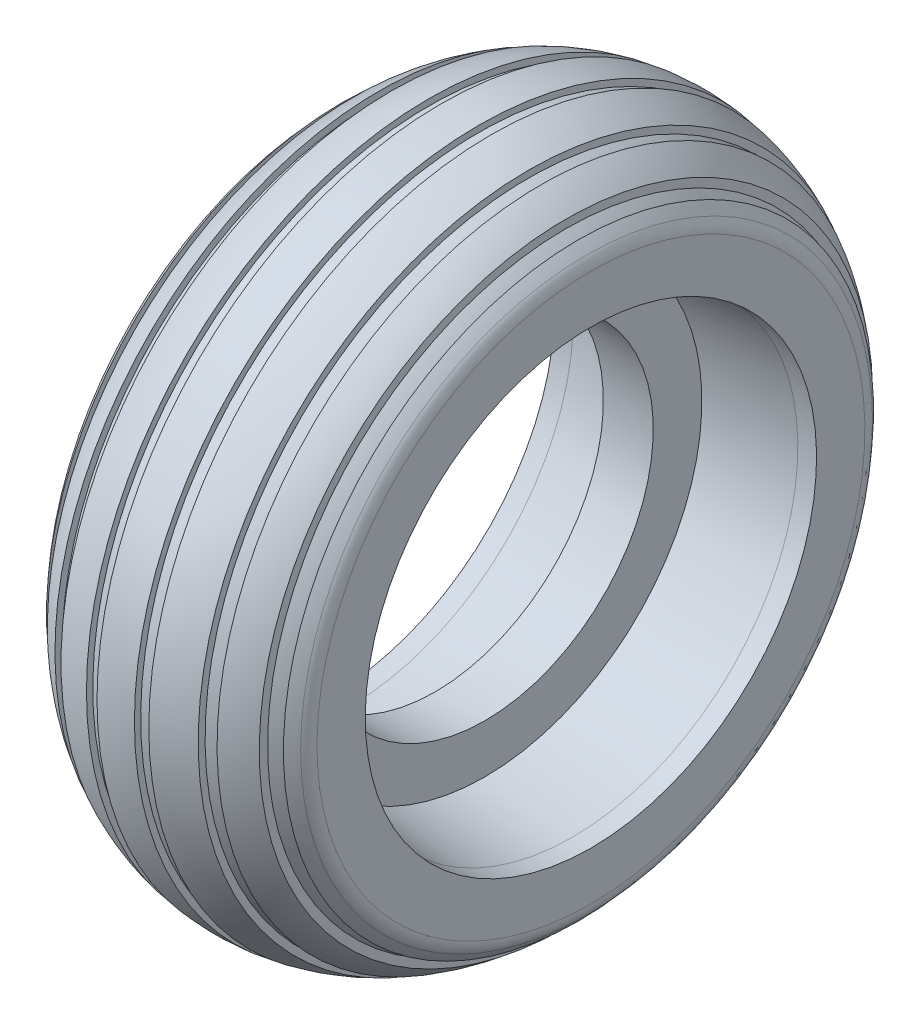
from build123d import *


with BuildPart() as part:
    # Esquisse1 → R_volution2 (revolve)
    with BuildSketch(Plane.XY, mode=Mode.PRIVATE) as r_volution2_sk:
        with BuildLine():
            Line((-10.5, 18.1), (-10.5, 21.976504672))
            ThreePointArc((-10.5, 21.976504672), (-10.410784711, 22.486099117), (-10.153751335, 22.935075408))
            ThreePointArc((-10.153751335, 22.935075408), (-9.833651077, 23.306120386), (-9.5, 23.665029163))
            Line((-9.5, 23.665029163), (-9.5, 22.929010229))
            ThreePointArc((-9.5, 22.929010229), (-9.014084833, 23.446702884), (-8.5, 23.936433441))
            Line((-8.5, 23.936433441), (-8.5, 24.599305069))
            ThreePointArc((-8.5, 24.599305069), (-7.532111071, 25.340287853), (-6.5, 25.988833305))
            Line((-6.5, 25.988833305), (-6.5, 25.410703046))
            ThreePointArc((-6.5, 25.410703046), (-6.005997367, 25.690214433), (-5.5, 25.947375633))
            Line((-5.5, 25.947375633), (-5.5, 26.499679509))
            ThreePointArc((-5.5, 26.499679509), (-4.028782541, 27.07020773), (-2.5, 27.461113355))
            Line((-2.5, 27.461113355), (-2.5, 26.951525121))
            ThreePointArc((-2.5, 26.951525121), (-2.001591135, 27.041289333), (-1.5, 27.111112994))
            Line((-1.5, 27.111112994), (-1.5, 27.614502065))
            ThreePointArc((-1.5, 27.614502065), (0, 27.7), (1.5, 27.614502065))
            Line((1.5, 27.614502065), (1.5, 27.111112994))
            ThreePointArc((1.5, 27.111112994), (2.001591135, 27.041289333), (2.5, 26.951525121))
            Line((2.5, 26.951525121), (2.5, 27.461113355))
            ThreePointArc((2.5, 27.461113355), (4.028782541, 27.07020773), (5.5, 26.499679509))
            Line((5.5, 26.499679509), (5.5, 25.947375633))
            ThreePointArc((5.5, 25.947375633), (6.005997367, 25.690214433), (6.5, 25.410703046))
            Line((6.5, 25.410703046), (6.5, 25.988833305))
            ThreePointArc((6.5, 25.988833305), (7.532111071, 25.340287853), (8.5, 24.599305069))
            Line((8.5, 24.599305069), (8.5, 23.936433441))
            ThreePointArc((8.5, 23.936433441), (9.014084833, 23.446702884), (9.5, 22.929010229))
            Line((9.5, 22.929010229), (9.5, 23.665029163))
            ThreePointArc((9.5, 23.665029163), (9.833651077, 23.306120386), (10.153751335, 22.935075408))
            ThreePointArc((10.153751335, 22.935075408), (10.410784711, 22.486099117), (10.5, 21.976504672))
            Line((10.5, 21.976504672), (10.5, 18.1))
            Line((10.5, 18.1), (9, 18.1))
            Line((9, 18.1), (2, 17.4))
            Line((2, 17.4), (2, 13.5))
            Line((2, 13.5), (-2, 13.5))
            Line((-2, 13.5), (-2, 17.4))
            Line((-2, 17.4), (-9, 18.1))
            Line((-9, 18.1), (-10.5, 18.1))
        make_face()
    revolve(r_volution2_sk.sketch.rotate(Axis((-61.488945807, 0, 0), (1, 0, 0)), 180), axis=Axis((-61.488945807, 0, 0), (1, 0, 0)))


solid = part.part
